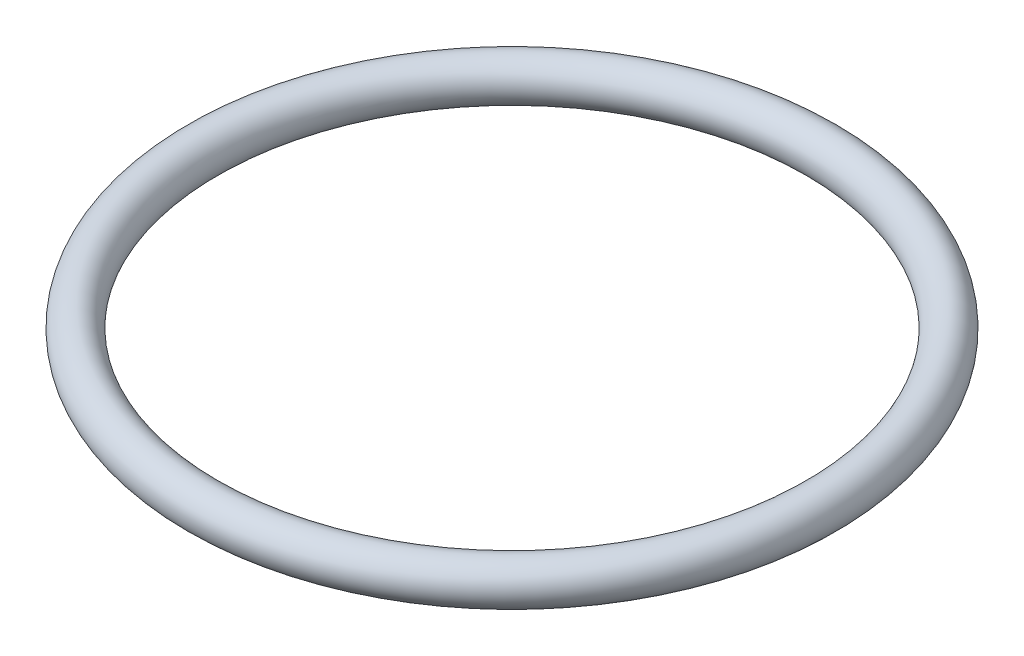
from build123d import *

# Parameters (mm, degrees)
SKETCH1_R = 1.3081


with BuildPart() as part:
    # Sketch1 → Revolve1 (revolve)
    with BuildSketch(Plane.XY, mode=Mode.PRIVATE) as revolve1_sk:
        with Locations((19.3929, 0)):
            Circle(SKETCH1_R)
    revolve(revolve1_sk.sketch.rotate(Axis((0, 3.724897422, 0), (0, -1, 0)), 90), axis=Axis((0, 3.724897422, 0), (0, -1, 0)))


solid = part.part
